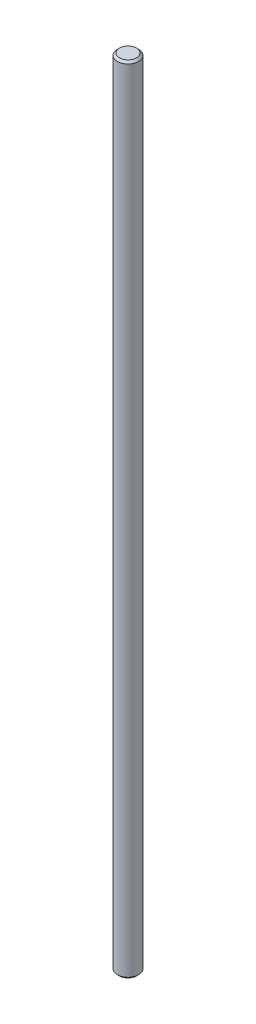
from build123d import *

# Parameters (mm, degrees)
SKETCH1_R      = 2
EXTRUDE1_DEPTH = 150
CHAMFER1_SIZE  = 0.4


with BuildPart() as part:
    # Sketch1 → Extrude1 (new body)
    with BuildSketch(Plane(origin=(0, 0, 0), x_dir=(1, 0, 0), z_dir=(0, 1, 0))):
        with Locations(Location((0, 0, 0), (0, 0, 270))):
            Circle(SKETCH1_R)
    extrude(amount=EXTRUDE1_DEPTH)

    # Chamfer1
    chamfer1_edges = [part.edges().sort_by_distance(p)[0] for p in [
        (0, 0, -2),
        (0, 150, -2),
    ]]
    chamfer(chamfer1_edges, length=CHAMFER1_SIZE)


solid = part.part
